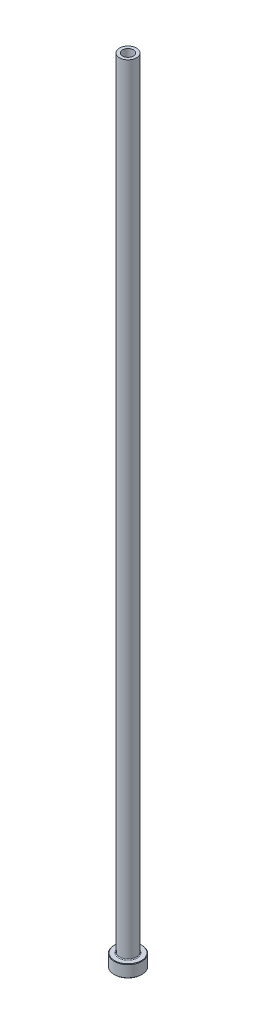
from build123d import *

# Parameters (mm, degrees)
CHAMFER1_SIZE = 0.254


with BuildPart() as part:
    # Sketch1 → Revolve1 (revolve)
    with BuildSketch(Plane.XY, mode=Mode.PRIVATE) as revolve1_sk:
        with BuildLine():
            Line((0, 0), (7.1374, 0))
            Line((7.1374, 0), (7.1374, 6.35))
            Line((7.1374, 6.35), (4.755515, 6.35))
            ThreePointArc((4.755515, 6.35), (4.474881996, 6.466241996), (4.35864, 6.746875))
            Line((4.35864, 6.746875), (4.35864, 406.4))
            Line((4.35864, 406.4), (0, 406.4))
            Line((0, 406.4), (0, 0))
        make_face()
    revolve(revolve1_sk.sketch.rotate(Axis((0, 0, 0), (0, 1, 0)), 90), axis=Axis((0, 0, 0), (0, 1, 0)))

    # Sketch2 → Cut-Revolve1 (revolve, cut)
    with BuildSketch(Plane.XY, mode=Mode.PRIVATE) as cut_revolve1_sk:
        Polygon((3.3655, 0), (2.968625, 0.396875), (2.968625, 322.2625), (2.77749, 336.55), (2.77749, 406.4), (0, 406.4), (0, 0), align=None)
    revolve(cut_revolve1_sk.sketch.rotate(Axis((0, 0, 0), (0, 1, 0)), 90), axis=Axis((0, 0, 0), (0, 1, 0)), mode=Mode.SUBTRACT)

    # Chamfer1
    chamfer1_edges = [part.edges().sort_by_distance(p)[0] for p in [
        (0, 6.35, 7.1374),
        (0, 0, 7.1374),
    ]]
    chamfer(chamfer1_edges, length=CHAMFER1_SIZE)


solid = part.part
